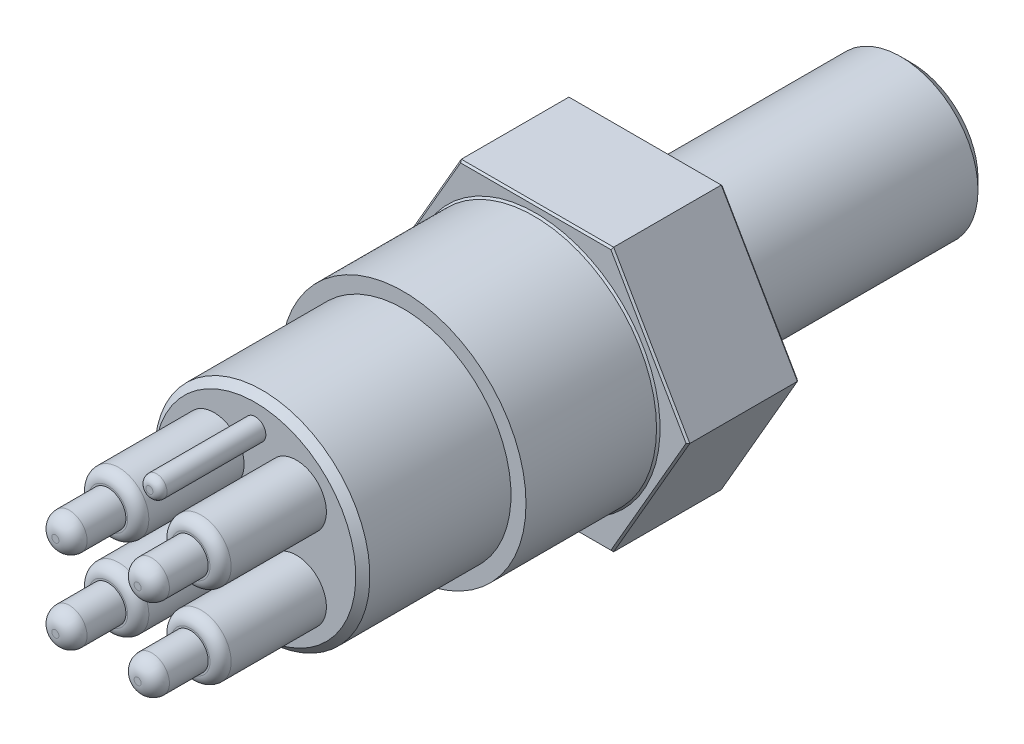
from build123d import *

# Parameters (mm, degrees)
SKETCH1_R        = 5.55625
POST_DEPTH       = 19.05
CHAMFER1_SIZE    = 0.762
HEX_2_DEPTH      = 8.001
SKETCH5_R        = 8.8265
EXTRUDE1_DEPTH   = 9.525
CHAMFER2_SIZE    = 0.127
SKETCH3_R        = 7.747
RUBBER_DEPTH     = 10.668
CHAMFER3_SIZE    = 0.508
SKETCH4_R        = 0.762
SKETCH4_R_2      = 2.159
PINS_DEPTH       = 7.62
SKETCH6_R        = 1.27
PIN_TIPS_DEPTH   = 3.81
PIN_TIP_RADIUS_R = 1.016
GUIDE_PIT_TIP_R  = 0.508
FILLET3_R        = 0.762


with BuildPart() as part:
    # Sketch1 → post (new body)
    with BuildSketch(Plane.XY):
        Circle(SKETCH1_R)
    extrude(amount=-POST_DEPTH)

    # Chamfer1
    chamfer1_edges = [part.edges().sort_by_distance(p)[0] for p in [
        (-5.55625, 0, -19.05),
    ]]
    chamfer(chamfer1_edges, length=CHAMFER1_SIZE)

    # Sketch2 → hex 2 (add)
    with BuildSketch(Plane.XY):
        Polygon((-5.484596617, 9.4996), (-10.969193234, 0), (-5.484596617, -9.4996), (5.484596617, -9.4996), (10.969193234, 0), (5.484596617, 9.4996), align=None)
    extrude(amount=HEX_2_DEPTH)

    # Sketch5 → Extrude1 (add)
    with BuildSketch(Plane.XY.offset(8.001)):
        with Locations(Location((0, 0, 0), (0, 0, 180))):
            Circle(SKETCH5_R)
    extrude(amount=EXTRUDE1_DEPTH)

    # Chamfer2
    chamfer2_edges = [part.edges().sort_by_distance(p)[0] for p in [
        (-8.226894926, 4.7498, 8.001),
        (0, 9.4996, 0),
        (0, 9.4996, 8.001),
        (-8.226894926, -4.7498, 0),
        (-8.226894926, -4.7498, 8.001),
        (8.226894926, 4.7498, 0),
        (0, -9.4996, 0),
        (8.226894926, -4.7498, 0),
        (8.226894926, 4.7498, 8.001),
        (0, -9.4996, 8.001),
        (8.226894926, -4.7498, 8.001),
        (8.8265, 0, 8.001),
    ]]
    chamfer(chamfer2_edges, length=CHAMFER2_SIZE)

    # Sketch3 → rubber (add)
    with BuildSketch(Plane.XY.offset(17.526)):
        with Locations(Location((0, 0, 0), (0, 0, 180))):
            Circle(SKETCH3_R)
    extrude(amount=RUBBER_DEPTH)

    # Chamfer3
    chamfer3_edges = [part.edges().sort_by_distance(p)[0] for p in [
        (7.747, 0, 28.194),
    ]]
    chamfer(chamfer3_edges, length=CHAMFER3_SIZE)

    # Sketch4 → PINS (add)
    with BuildSketch(Plane.XY.offset(28.194)):
        with Locations(Location((0, 5.588, 0), (0, 0, 180))):
            Circle(SKETCH4_R)
        with Locations(Location((2.96348452, -2.96348452, 0), (0, 0, 180))):
            Circle(SKETCH4_R_2)
        with Locations(Location((-2.96348452, 2.96348452, 0), (0, 0, 180))):
            Circle(SKETCH4_R_2)
        with Locations(Location((-2.96348452, -2.96348452, 0), (0, 0, 180))):
            Circle(SKETCH4_R_2)
        with Locations(Location((2.96348452, 2.96348452, 0), (0, 0, 180))):
            Circle(SKETCH4_R_2)
    extrude(amount=PINS_DEPTH)

    # Sketch6 → pin tips (add)
    with BuildSketch(Plane.XY.offset(35.814)):
        with Locations(Location((-2.96348452, 2.96348452, 0), (0, 0, 180))):
            Circle(SKETCH6_R)
        with Locations(Location((-2.96348452, -2.96348452, 0), (0, 0, 180))):
            Circle(SKETCH6_R)
        with Locations(Location((2.96348452, 2.96348452, 0), (0, 0, 180))):
            Circle(SKETCH6_R)
        with Locations(Location((2.96348452, -2.96348452, 0), (0, 0, 180))):
            Circle(SKETCH6_R)
    extrude(amount=PIN_TIPS_DEPTH)

    # pin tip radius
    pin_tip_radius_edges = [part.edges().sort_by_distance(p)[0] for p in [
        (-1.69348452, -2.96348452, 39.624),
        (4.23348452, -2.96348452, 39.624),
        (-1.69348452, 2.96348452, 39.624),
        (4.23348452, 2.96348452, 39.624),
    ]]
    fillet(pin_tip_radius_edges, radius=PIN_TIP_RADIUS_R)

    # guide pit tip
    guide_pit_tip_edges = [part.edges().sort_by_distance(p)[0] for p in [
        (0.762, 5.588, 35.814),
    ]]
    fillet(guide_pit_tip_edges, radius=GUIDE_PIT_TIP_R)

    # Fillet3
    fillet3_edges = [part.edges().sort_by_distance(p)[0] for p in [
        (-0.80448452, -2.96348452, 35.814),
        (5.12248452, -2.96348452, 35.814),
        (-0.80448452, 2.96348452, 35.814),
        (5.12248452, 2.96348452, 35.814),
    ]]
    fillet(fillet3_edges, radius=FILLET3_R)


solid = part.part
